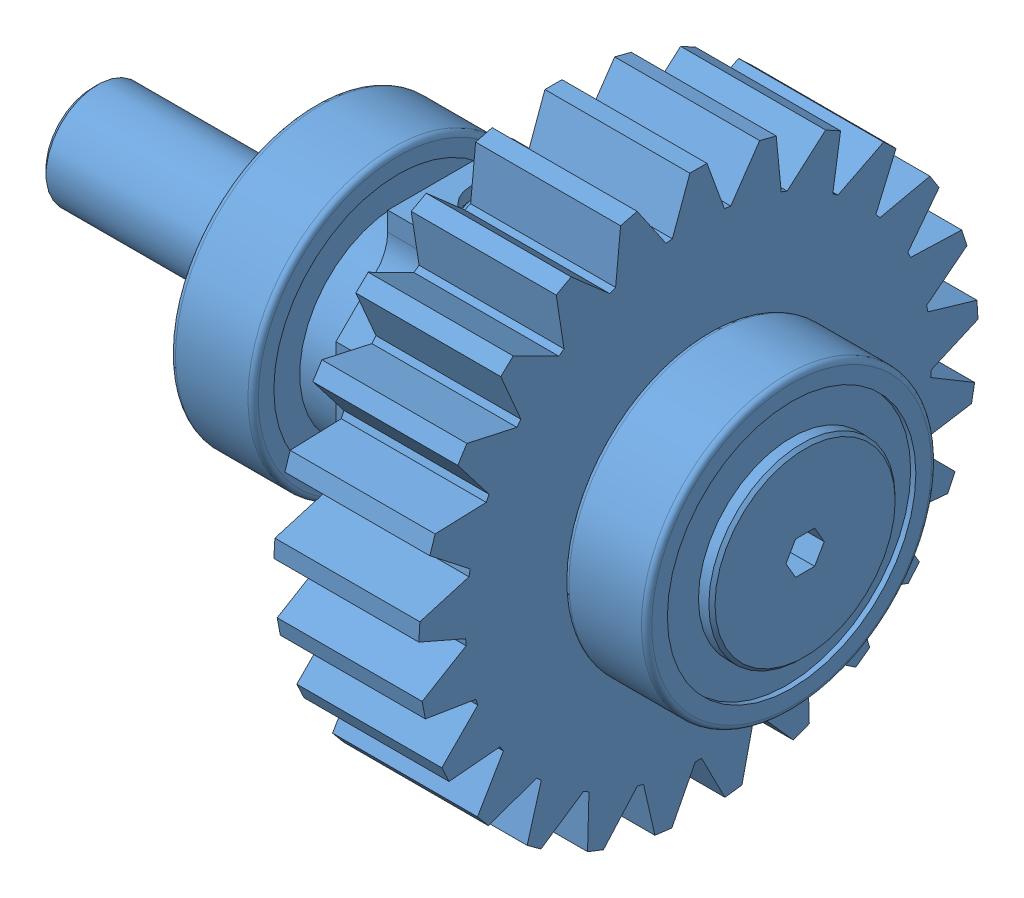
SolidWorks assembly gbox_input.sldasm, configuration Default (file format 3400). Lengths in mm.
Overall size (68.8 53.89 54).
12 component instances, 10 part files, 4 mates.
Components (placement in the parent):
- wheel_gbox_shaft_input-1: wheel_gbox_shaft_input.sldprt [Default] at origin size (67 14 14) (hidden)
- wheel_gbox_pinion_1s-1: wheel_gbox_pinion_1s.sldprt [Default] at (60 0 0) x (0 0 1) z (-1 0 0) size (54 53.89 24) (hidden)
- spacer_12x18x5mm-1: spacer_12x18x5mm.sldprt [Default] at (38 0 0) size (5 19 19) (hidden)
- spacer_12x20x1mm-1: spacer_12x20x1mm.sldprt [Default] at (67 0 0) size (1 20 20) (hidden)
- bearing_12x28x8mm-1: bearing_12x28x8mm.sldprt [Default] at (38 0 0) size (8 28 28) (hidden)
- bearing_12x28x8mm-2: bearing_12x28x8mm.sldprt [Default] at (76 0 0) size (8 28 28) (hidden)
- spacer_10x18x014mm-1: spacer_10x18x014mm.sldprt [Default] at (28.6 0 0) size (1.4 18 18) (hidden)
- wheel_gbox_sft_mid_washer-1: wheel_gbox_sft_mid_washer.sldprt [Default] at (76 0 0) x (-1 0 0) z (0 0 1) size (1.3 18 18) (hidden)
- screw_tapper_head_5x15-1: screw_tapper_head_5x15.sldprt [Default] at (77.3 0 0) size (15 10 10) (hidden)
- screw_set_tip_6x6-1: screw_set_tip_6x6.sldprt [Default] at (48 13.5 0) x (0 1 0) z (0 0 1) size (6.5 6 6) (hidden)
- screw_set_tip_6x6-2: screw_set_tip_6x6.sldprt [Default] at (48 -13.513 0) x (0 -1 0) z (0 0 1) size (6.5 6 6) (hidden)
- gbox_input-1: gbox_input.SLDPRT [Default] at (75.5 0 0) x (0 0 -1) z (1 0 0) size (54 53.89 68.8)
Mates (geometry in assembly coordinates):
- InPlace1: in place: plane of bearing_12x28x8mm-2 through (75.5 0 0) normal (1 0 0); unknown of gbox_input-1
- Coincident1: coincident aligned: plane of ?; plane of ?
- Coincident2: coincident aligned: moOrthogonalPlaneRef_w of ?; plane of ?
- Coincident3: coincident anti-aligned: moOrthogonalPlaneRef_w of ?; plane of ?
